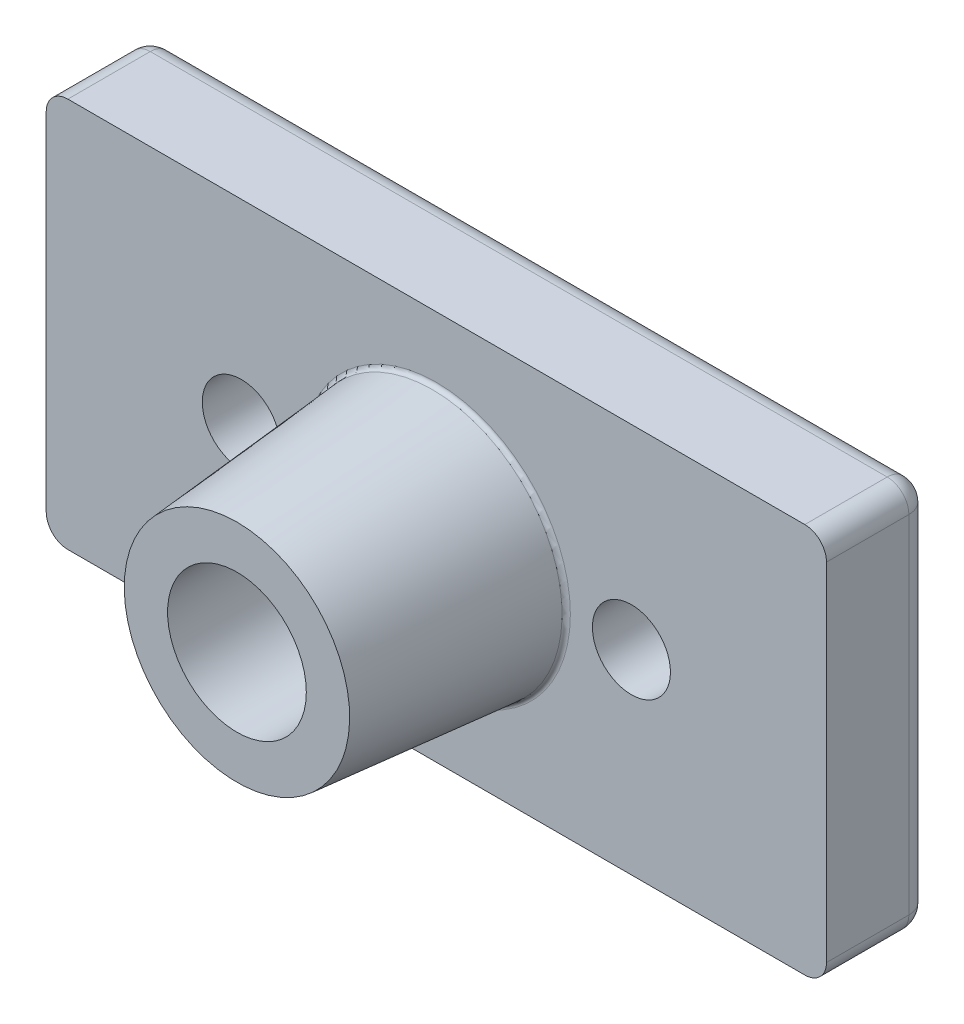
ISO-10303-21;
HEADER;
FILE_DESCRIPTION(('STEP AP214'),'2;1');
FILE_NAME('part.step','',(''),(''),'','','');
FILE_SCHEMA(('AUTOMOTIVE_DESIGN { 1 0 10303 214 1 1 1 1 }'));
ENDSEC;
DATA;
#1=APPLICATION_CONTEXT('core data for automotive mechanical design processes');
#2=APPLICATION_PROTOCOL_DEFINITION('international standard','automotive_design',2000,#1);
#3=PRODUCT_CONTEXT('',#1,'mechanical');
#4=PRODUCT('Part','Part','',(#3));
#5=PRODUCT_RELATED_PRODUCT_CATEGORY('part','',(#4));
#6=PRODUCT_DEFINITION_FORMATION('','',#4);
#7=PRODUCT_DEFINITION_CONTEXT('part definition',#1,'design');
#8=PRODUCT_DEFINITION('design','',#6,#7);
#9=PRODUCT_DEFINITION_SHAPE('','',#8);
#10=(LENGTH_UNIT() NAMED_UNIT(*) SI_UNIT(.MILLI.,.METRE.));
#11=(NAMED_UNIT(*) PLANE_ANGLE_UNIT() SI_UNIT($,.RADIAN.));
#12=(NAMED_UNIT(*) SI_UNIT($,.STERADIAN.) SOLID_ANGLE_UNIT());
#13=UNCERTAINTY_MEASURE_WITH_UNIT(LENGTH_MEASURE(1.E-05),#10,'distance_accuracy_value','');
#14=(GEOMETRIC_REPRESENTATION_CONTEXT(3) GLOBAL_UNCERTAINTY_ASSIGNED_CONTEXT((#13)) GLOBAL_UNIT_ASSIGNED_CONTEXT((#10,
#11,#12)) REPRESENTATION_CONTEXT('',''));
#15=CARTESIAN_POINT('',(0.,0.,0.));
#16=DIRECTION('',(0.,0.,1.));
#17=DIRECTION('',(1.,0.,0.));
#18=AXIS2_PLACEMENT_3D('',#15,#16,#17);
#19=CARTESIAN_POINT('',(0.,0.,0.));
#20=DIRECTION('',(0.,0.,1.));
#21=DIRECTION('',(1.,0.,0.));
#22=AXIS2_PLACEMENT_3D('',#19,#20,#21);
#23=CYLINDRICAL_SURFACE('',#22,8.);
#24=CARTESIAN_POINT('',(0.,0.,0.));
#25=DIRECTION('',(0.,0.,1.));
#26=DIRECTION('',(1.,0.,0.));
#27=AXIS2_PLACEMENT_3D('',#24,#25,#26);
#28=CIRCLE('',#27,8.);
#29=CARTESIAN_POINT('',(8.,0.,0.));
#30=VERTEX_POINT('',#29);
#31=EDGE_CURVE('E19',#30,#30,#28,.F.);
#32=ORIENTED_EDGE('',*,*,#31,.T.);
#33=EDGE_LOOP('',(#32));
#34=FACE_BOUND('',#33,.T.);
#35=CARTESIAN_POINT('',(0.,0.,35.));
#36=DIRECTION('',(0.,0.,1.));
#37=DIRECTION('',(1.,0.,0.));
#38=AXIS2_PLACEMENT_3D('',#35,#36,#37);
#39=CIRCLE('',#38,8.);
#40=CARTESIAN_POINT('',(8.,0.,35.));
#41=VERTEX_POINT('',#40);
#42=EDGE_CURVE('E116',#41,#41,#39,.F.);
#43=ORIENTED_EDGE('',*,*,#42,.F.);
#44=EDGE_LOOP('',(#43));
#45=FACE_BOUND('',#44,.T.);
#46=ADVANCED_FACE('F15',(#34,#45),#23,.F.);
#47=CARTESIAN_POINT('',(0.,0.,0.));
#48=DIRECTION('',(0.,0.,1.));
#49=DIRECTION('',(1.,0.,0.));
#50=AXIS2_PLACEMENT_3D('',#47,#48,#49);
#51=PLANE('',#50);
#52=CARTESIAN_POINT('',(22.5,0.,0.));
#53=DIRECTION('',(0.,0.,1.));
#54=DIRECTION('',(1.,0.,0.));
#55=AXIS2_PLACEMENT_3D('',#52,#53,#54);
#56=CIRCLE('',#55,7.5);
#57=CARTESIAN_POINT('',(30.,0.,0.));
#58=VERTEX_POINT('',#57);
#59=EDGE_CURVE('E120',#58,#58,#56,.T.);
#60=ORIENTED_EDGE('',*,*,#59,.T.);
#61=EDGE_LOOP('',(#60));
#62=FACE_BOUND('',#61,.T.);
#63=CARTESIAN_POINT('',(-22.5,0.,0.));
#64=DIRECTION('',(0.,0.,1.));
#65=DIRECTION('',(1.,0.,0.));
#66=AXIS2_PLACEMENT_3D('',#63,#64,#65);
#67=CIRCLE('',#66,7.5);
#68=CARTESIAN_POINT('',(-15.,0.,0.));
#69=VERTEX_POINT('',#68);
#70=EDGE_CURVE('E122',#69,#69,#67,.T.);
#71=ORIENTED_EDGE('',*,*,#70,.T.);
#72=EDGE_LOOP('',(#71));
#73=FACE_BOUND('',#72,.T.);
#74=ORIENTED_EDGE('',*,*,#31,.F.);
#75=EDGE_LOOP('',(#74));
#76=FACE_BOUND('',#75,.T.);
#77=DIRECTION('',(0.,-1.,0.));
#78=VECTOR('',#77,1.);
#79=CARTESIAN_POINT('',(-42.5,-10.,0.));
#80=LINE('',#79,#78);
#81=CARTESIAN_POINT('',(-42.5,20.,0.));
#82=VERTEX_POINT('',#81);
#83=CARTESIAN_POINT('',(-42.5,-20.,0.));
#84=VERTEX_POINT('',#83);
#85=EDGE_CURVE('E142',#82,#84,#80,.T.);
#86=ORIENTED_EDGE('',*,*,#85,.F.);
#87=DIRECTION('',(-1.,0.,0.));
#88=VECTOR('',#87,1.);
#89=CARTESIAN_POINT('',(-21.25,20.,0.));
#90=LINE('',#89,#88);
#91=CARTESIAN_POINT('',(42.5,20.,0.));
#92=VERTEX_POINT('',#91);
#93=EDGE_CURVE('E119',#92,#82,#90,.T.);
#94=ORIENTED_EDGE('',*,*,#93,.F.);
#95=DIRECTION('',(0.,1.,0.));
#96=VECTOR('',#95,1.);
#97=CARTESIAN_POINT('',(42.5,10.,0.));
#98=LINE('',#97,#96);
#99=CARTESIAN_POINT('',(42.5,-20.,0.));
#100=VERTEX_POINT('',#99);
#101=EDGE_CURVE('E266',#100,#92,#98,.T.);
#102=ORIENTED_EDGE('',*,*,#101,.F.);
#103=DIRECTION('',(1.,0.,0.));
#104=VECTOR('',#103,1.);
#105=CARTESIAN_POINT('',(21.25,-20.,0.));
#106=LINE('',#105,#104);
#107=EDGE_CURVE('E149',#84,#100,#106,.T.);
#108=ORIENTED_EDGE('',*,*,#107,.F.);
#109=EDGE_LOOP('',(#86,#94,#102,#108));
#110=FACE_BOUND('',#109,.T.);
#111=ADVANCED_FACE('F131',(#62,#73,#76,#110),#51,.F.);
#112=CARTESIAN_POINT('',(-22.5,0.,0.));
#113=DIRECTION('',(0.,0.,1.));
#114=DIRECTION('',(1.,0.,0.));
#115=AXIS2_PLACEMENT_3D('',#112,#113,#114);
#116=CYLINDRICAL_SURFACE('',#115,7.5);
#117=CARTESIAN_POINT('',(-22.5,0.,5.5));
#118=DIRECTION('',(0.,0.,1.));
#119=DIRECTION('',(1.,0.,0.));
#120=AXIS2_PLACEMENT_3D('',#117,#118,#119);
#121=CIRCLE('',#120,7.5);
#122=CARTESIAN_POINT('',(-15.,0.,5.5));
#123=VERTEX_POINT('',#122);
#124=EDGE_CURVE('E112',#123,#123,#121,.T.);
#125=ORIENTED_EDGE('',*,*,#124,.T.);
#126=EDGE_LOOP('',(#125));
#127=FACE_BOUND('',#126,.T.);
#128=ORIENTED_EDGE('',*,*,#70,.F.);
#129=EDGE_LOOP('',(#128));
#130=FACE_BOUND('',#129,.T.);
#131=ADVANCED_FACE('F134',(#127,#130),#116,.F.);
#132=CARTESIAN_POINT('',(22.5,0.,0.));
#133=DIRECTION('',(0.,0.,1.));
#134=DIRECTION('',(1.,0.,0.));
#135=AXIS2_PLACEMENT_3D('',#132,#133,#134);
#136=CYLINDRICAL_SURFACE('',#135,7.5);
#137=CARTESIAN_POINT('',(22.5,0.,5.5));
#138=DIRECTION('',(0.,0.,1.));
#139=DIRECTION('',(1.,0.,0.));
#140=AXIS2_PLACEMENT_3D('',#137,#138,#139);
#141=CIRCLE('',#140,7.5);
#142=CARTESIAN_POINT('',(30.,0.,5.5));
#143=VERTEX_POINT('',#142);
#144=EDGE_CURVE('E109',#143,#143,#141,.T.);
#145=ORIENTED_EDGE('',*,*,#144,.T.);
#146=EDGE_LOOP('',(#145));
#147=FACE_BOUND('',#146,.T.);
#148=ORIENTED_EDGE('',*,*,#59,.F.);
#149=EDGE_LOOP('',(#148));
#150=FACE_BOUND('',#149,.T.);
#151=ADVANCED_FACE('F182',(#147,#150),#136,.F.);
#152=CARTESIAN_POINT('',(-10.5,0.,35.));
#153=DIRECTION('',(0.,0.,1.));
#154=DIRECTION('',(1.,0.,0.));
#155=AXIS2_PLACEMENT_3D('',#152,#153,#154);
#156=PLANE('',#155);
#157=ORIENTED_EDGE('',*,*,#42,.T.);
#158=EDGE_LOOP('',(#157));
#159=FACE_BOUND('',#158,.T.);
#160=CARTESIAN_POINT('',(0.,0.,35.0000000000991));
#161=DIRECTION('',(0.,0.,-1.));
#162=DIRECTION('',(0.,1.,0.));
#163=AXIS2_PLACEMENT_3D('',#160,#161,#162);
#164=CIRCLE('',#163,13.0000000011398);
#165=CARTESIAN_POINT('',(0.,13.0000000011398,35.0000000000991));
#166=VERTEX_POINT('',#165);
#167=EDGE_CURVE('E105',#166,#166,#164,.T.);
#168=ORIENTED_EDGE('',*,*,#167,.F.);
#169=EDGE_LOOP('',(#168));
#170=FACE_BOUND('',#169,.T.);
#171=ADVANCED_FACE('F179',(#159,#170),#156,.T.);
#172=CARTESIAN_POINT('',(-21.25,20.,2.5));
#173=DIRECTION('',(-1.,0.,0.));
#174=DIRECTION('',(0.,0.,1.));
#175=AXIS2_PLACEMENT_3D('',#172,#173,#174);
#176=CYLINDRICAL_SURFACE('',#175,2.5);
#177=CARTESIAN_POINT('',(-42.5,20.,2.5));
#178=DIRECTION('',(1.,0.,0.));
#179=DIRECTION('',(0.,1.,0.));
#180=AXIS2_PLACEMENT_3D('',#177,#178,#179);
#181=CIRCLE('',#180,2.5);
#182=CARTESIAN_POINT('',(-42.5,22.5,2.5));
#183=VERTEX_POINT('',#182);
#184=EDGE_CURVE('E162',#183,#82,#181,.F.);
#185=ORIENTED_EDGE('',*,*,#184,.F.);
#186=DIRECTION('',(1.,0.,0.));
#187=VECTOR('',#186,1.);
#188=CARTESIAN_POINT('',(-42.5,22.5,2.5));
#189=LINE('',#188,#187);
#190=CARTESIAN_POINT('',(42.5,22.5,2.5));
#191=VERTEX_POINT('',#190);
#192=EDGE_CURVE('E108',#191,#183,#189,.F.);
#193=ORIENTED_EDGE('',*,*,#192,.F.);
#194=CARTESIAN_POINT('',(42.5,20.,2.5));
#195=DIRECTION('',(1.,0.,0.));
#196=DIRECTION('',(0.,1.,0.));
#197=AXIS2_PLACEMENT_3D('',#194,#195,#196);
#198=CIRCLE('',#197,2.5);
#199=EDGE_CURVE('E263',#92,#191,#198,.T.);
#200=ORIENTED_EDGE('',*,*,#199,.F.);
#201=ORIENTED_EDGE('',*,*,#93,.T.);
#202=EDGE_LOOP('',(#185,#193,#200,#201));
#203=FACE_BOUND('',#202,.T.);
#204=ADVANCED_FACE('F175',(#203),#176,.T.);
#205=CARTESIAN_POINT('',(-42.5,20.,2.5));
#206=DIRECTION('',(1.,0.,0.));
#207=DIRECTION('',(0.,1.,0.));
#208=AXIS2_PLACEMENT_3D('',#205,#206,#207);
#209=SPHERICAL_SURFACE('',#208,2.5);
#210=CARTESIAN_POINT('',(-42.5,20.,2.5));
#211=DIRECTION('',(0.,0.,1.));
#212=DIRECTION('',(1.,0.,0.));
#213=AXIS2_PLACEMENT_3D('',#210,#211,#212);
#214=CIRCLE('',#213,2.5);
#215=CARTESIAN_POINT('',(-45.,20.,2.5));
#216=VERTEX_POINT('',#215);
#217=EDGE_CURVE('E73',#183,#216,#214,.T.);
#218=ORIENTED_EDGE('',*,*,#217,.F.);
#219=ORIENTED_EDGE('',*,*,#184,.T.);
#220=CARTESIAN_POINT('',(-42.5,20.,2.5));
#221=DIRECTION('',(0.,-1.,0.));
#222=DIRECTION('',(0.,0.,-1.));
#223=AXIS2_PLACEMENT_3D('',#220,#221,#222);
#224=CIRCLE('',#223,2.5);
#225=EDGE_CURVE('E155',#216,#82,#224,.T.);
#226=ORIENTED_EDGE('',*,*,#225,.F.);
#227=EDGE_LOOP('',(#218,#219,#226));
#228=FACE_BOUND('',#227,.T.);
#229=ADVANCED_FACE('F171',(#228),#209,.T.);
#230=CARTESIAN_POINT('',(-42.5,-10.,2.5));
#231=DIRECTION('',(0.,-1.,0.));
#232=DIRECTION('',(0.,0.,-1.));
#233=AXIS2_PLACEMENT_3D('',#230,#231,#232);
#234=CYLINDRICAL_SURFACE('',#233,2.5);
#235=CARTESIAN_POINT('',(-42.5,-20.,2.5));
#236=DIRECTION('',(0.,1.,0.));
#237=DIRECTION('',(1.,0.,0.));
#238=AXIS2_PLACEMENT_3D('',#235,#236,#237);
#239=CIRCLE('',#238,2.5);
#240=CARTESIAN_POINT('',(-45.,-20.,2.5));
#241=VERTEX_POINT('',#240);
#242=EDGE_CURVE('E154',#241,#84,#239,.F.);
#243=ORIENTED_EDGE('',*,*,#242,.F.);
#244=DIRECTION('',(0.,1.,0.));
#245=VECTOR('',#244,1.);
#246=CARTESIAN_POINT('',(-45.,-20.,2.5));
#247=LINE('',#246,#245);
#248=EDGE_CURVE('E77',#216,#241,#247,.F.);
#249=ORIENTED_EDGE('',*,*,#248,.F.);
#250=ORIENTED_EDGE('',*,*,#225,.T.);
#251=ORIENTED_EDGE('',*,*,#85,.T.);
#252=EDGE_LOOP('',(#243,#249,#250,#251));
#253=FACE_BOUND('',#252,.T.);
#254=ADVANCED_FACE('F159',(#253),#234,.T.);
#255=CARTESIAN_POINT('',(-42.5,-20.,2.5));
#256=DIRECTION('',(1.,0.,0.));
#257=DIRECTION('',(0.,1.,0.));
#258=AXIS2_PLACEMENT_3D('',#255,#256,#257);
#259=SPHERICAL_SURFACE('',#258,2.5);
#260=CARTESIAN_POINT('',(-42.5,-20.,2.5));
#261=DIRECTION('',(0.,0.,1.));
#262=DIRECTION('',(1.,0.,0.));
#263=AXIS2_PLACEMENT_3D('',#260,#261,#262);
#264=CIRCLE('',#263,2.50000000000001);
#265=CARTESIAN_POINT('',(-42.5,-22.5,2.5));
#266=VERTEX_POINT('',#265);
#267=EDGE_CURVE('E76',#241,#266,#264,.T.);
#268=ORIENTED_EDGE('',*,*,#267,.F.);
#269=ORIENTED_EDGE('',*,*,#242,.T.);
#270=CARTESIAN_POINT('',(-42.5,-20.,2.5));
#271=DIRECTION('',(1.,0.,0.));
#272=DIRECTION('',(0.,0.,-1.));
#273=AXIS2_PLACEMENT_3D('',#270,#271,#272);
#274=CIRCLE('',#273,2.5);
#275=EDGE_CURVE('E296',#266,#84,#274,.T.);
#276=ORIENTED_EDGE('',*,*,#275,.F.);
#277=EDGE_LOOP('',(#268,#269,#276));
#278=FACE_BOUND('',#277,.T.);
#279=ADVANCED_FACE('F288',(#278),#259,.T.);
#280=CARTESIAN_POINT('',(21.25,-20.,2.5));
#281=DIRECTION('',(1.,0.,0.));
#282=DIRECTION('',(0.,0.,-1.));
#283=AXIS2_PLACEMENT_3D('',#280,#281,#282);
#284=CYLINDRICAL_SURFACE('',#283,2.5);
#285=CARTESIAN_POINT('',(42.5,-20.,2.5));
#286=DIRECTION('',(1.,0.,0.));
#287=DIRECTION('',(0.,1.,0.));
#288=AXIS2_PLACEMENT_3D('',#285,#286,#287);
#289=CIRCLE('',#288,2.5);
#290=CARTESIAN_POINT('',(42.5,-22.5,2.50000000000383));
#291=VERTEX_POINT('',#290);
#292=EDGE_CURVE('E275',#291,#100,#289,.T.);
#293=ORIENTED_EDGE('',*,*,#292,.F.);
#294=DIRECTION('',(1.,0.,0.));
#295=VECTOR('',#294,1.);
#296=CARTESIAN_POINT('',(42.5,-22.5,2.5));
#297=LINE('',#296,#295);
#298=EDGE_CURVE('E276',#266,#291,#297,.T.);
#299=ORIENTED_EDGE('',*,*,#298,.F.);
#300=ORIENTED_EDGE('',*,*,#275,.T.);
#301=ORIENTED_EDGE('',*,*,#107,.T.);
#302=EDGE_LOOP('',(#293,#299,#300,#301));
#303=FACE_BOUND('',#302,.T.);
#304=ADVANCED_FACE('F285',(#303),#284,.T.);
#305=CARTESIAN_POINT('',(42.5,-20.,2.5));
#306=DIRECTION('',(1.,0.,0.));
#307=DIRECTION('',(0.,1.,0.));
#308=AXIS2_PLACEMENT_3D('',#305,#306,#307);
#309=SPHERICAL_SURFACE('',#308,2.5);
#310=CARTESIAN_POINT('',(42.5,-20.,2.5));
#311=DIRECTION('',(0.,0.,1.));
#312=DIRECTION('',(1.,0.,0.));
#313=AXIS2_PLACEMENT_3D('',#310,#311,#312);
#314=CIRCLE('',#313,2.5);
#315=CARTESIAN_POINT('',(45.,-20.,2.5));
#316=VERTEX_POINT('',#315);
#317=EDGE_CURVE('E267',#291,#316,#314,.T.);
#318=ORIENTED_EDGE('',*,*,#317,.F.);
#319=ORIENTED_EDGE('',*,*,#292,.T.);
#320=CARTESIAN_POINT('',(42.5,-20.,2.5));
#321=DIRECTION('',(0.,1.,0.));
#322=DIRECTION('',(0.,0.,1.));
#323=AXIS2_PLACEMENT_3D('',#320,#321,#322);
#324=CIRCLE('',#323,2.5);
#325=EDGE_CURVE('E272',#316,#100,#324,.T.);
#326=ORIENTED_EDGE('',*,*,#325,.F.);
#327=EDGE_LOOP('',(#318,#319,#326));
#328=FACE_BOUND('',#327,.T.);
#329=ADVANCED_FACE('F282',(#328),#309,.T.);
#330=CARTESIAN_POINT('',(42.5,10.,2.5));
#331=DIRECTION('',(0.,1.,0.));
#332=DIRECTION('',(0.,0.,1.));
#333=AXIS2_PLACEMENT_3D('',#330,#331,#332);
#334=CYLINDRICAL_SURFACE('',#333,2.5);
#335=CARTESIAN_POINT('',(42.5,20.,2.5));
#336=DIRECTION('',(0.,1.,0.));
#337=DIRECTION('',(1.,0.,0.));
#338=AXIS2_PLACEMENT_3D('',#335,#336,#337);
#339=CIRCLE('',#338,2.5);
#340=CARTESIAN_POINT('',(45.,20.,2.5));
#341=VERTEX_POINT('',#340);
#342=EDGE_CURVE('E115',#341,#92,#339,.T.);
#343=ORIENTED_EDGE('',*,*,#342,.F.);
#344=DIRECTION('',(0.,1.,0.));
#345=VECTOR('',#344,1.);
#346=CARTESIAN_POINT('',(45.,20.,2.5));
#347=LINE('',#346,#345);
#348=EDGE_CURVE('E310',#316,#341,#347,.T.);
#349=ORIENTED_EDGE('',*,*,#348,.F.);
#350=ORIENTED_EDGE('',*,*,#325,.T.);
#351=ORIENTED_EDGE('',*,*,#101,.T.);
#352=EDGE_LOOP('',(#343,#349,#350,#351));
#353=FACE_BOUND('',#352,.T.);
#354=ADVANCED_FACE('F254',(#353),#334,.T.);
#355=CARTESIAN_POINT('',(42.5,20.,2.5));
#356=DIRECTION('',(1.,0.,0.));
#357=DIRECTION('',(0.,1.,0.));
#358=AXIS2_PLACEMENT_3D('',#355,#356,#357);
#359=SPHERICAL_SURFACE('',#358,2.5);
#360=CARTESIAN_POINT('',(42.5,20.,2.5));
#361=DIRECTION('',(0.,0.,1.));
#362=DIRECTION('',(1.,0.,0.));
#363=AXIS2_PLACEMENT_3D('',#360,#361,#362);
#364=CIRCLE('',#363,2.5);
#365=EDGE_CURVE('E312',#341,#191,#364,.T.);
#366=ORIENTED_EDGE('',*,*,#365,.F.);
#367=ORIENTED_EDGE('',*,*,#342,.T.);
#368=ORIENTED_EDGE('',*,*,#199,.T.);
#369=EDGE_LOOP('',(#366,#367,#368));
#370=FACE_BOUND('',#369,.T.);
#371=ADVANCED_FACE('F196',(#370),#359,.T.);
#372=CARTESIAN_POINT('',(-14.85,7.65,5.5));
#373=DIRECTION('',(0.,0.,1.));
#374=DIRECTION('',(-1.,0.,0.));
#375=AXIS2_PLACEMENT_3D('',#372,#373,#374);
#376=PLANE('',#375);
#377=CARTESIAN_POINT('',(-22.5,0.,5.5));
#378=DIRECTION('',(0.,0.,1.));
#379=DIRECTION('',(1.,0.,0.));
#380=AXIS2_PLACEMENT_3D('',#377,#378,#379);
#381=CIRCLE('',#380,4.5);
#382=CARTESIAN_POINT('',(-18.,0.,5.5));
#383=VERTEX_POINT('',#382);
#384=EDGE_CURVE('E102',#383,#383,#381,.T.);
#385=ORIENTED_EDGE('',*,*,#384,.T.);
#386=EDGE_LOOP('',(#385));
#387=FACE_BOUND('',#386,.T.);
#388=ORIENTED_EDGE('',*,*,#124,.F.);
#389=EDGE_LOOP('',(#388));
#390=FACE_BOUND('',#389,.T.);
#391=ADVANCED_FACE('F193',(#387,#390),#376,.F.);
#392=CARTESIAN_POINT('',(30.15,7.65,5.5));
#393=DIRECTION('',(0.,0.,1.));
#394=DIRECTION('',(-1.,0.,0.));
#395=AXIS2_PLACEMENT_3D('',#392,#393,#394);
#396=PLANE('',#395);
#397=CARTESIAN_POINT('',(22.5,0.,5.5));
#398=DIRECTION('',(0.,0.,1.));
#399=DIRECTION('',(1.,0.,0.));
#400=AXIS2_PLACEMENT_3D('',#397,#398,#399);
#401=CIRCLE('',#400,4.5);
#402=CARTESIAN_POINT('',(27.,0.,5.5));
#403=VERTEX_POINT('',#402);
#404=EDGE_CURVE('E99',#403,#403,#401,.T.);
#405=ORIENTED_EDGE('',*,*,#404,.T.);
#406=EDGE_LOOP('',(#405));
#407=FACE_BOUND('',#406,.T.);
#408=ORIENTED_EDGE('',*,*,#144,.F.);
#409=EDGE_LOOP('',(#408));
#410=FACE_BOUND('',#409,.T.);
#411=ADVANCED_FACE('F195',(#407,#410),#396,.F.);
#412=CARTESIAN_POINT('',(0.,0.,12.4566851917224));
#413=DIRECTION('',(0.,0.,-1.));
#414=DIRECTION('',(0.,1.,0.));
#415=AXIS2_PLACEMENT_3D('',#412,#413,#414);
#416=CONICAL_SURFACE('',#415,14.9602882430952,0.0867383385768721);
#417=CARTESIAN_POINT('',(0.,0.,12.4566851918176));
#418=DIRECTION('',(0.,0.,-1.));
#419=DIRECTION('',(0.,1.,0.));
#420=AXIS2_PLACEMENT_3D('',#417,#418,#419);
#421=CIRCLE('',#420,14.9602882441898);
#422=CARTESIAN_POINT('',(0.,14.9602882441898,12.4566851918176));
#423=VERTEX_POINT('',#422);
#424=EDGE_CURVE('E94',#423,#423,#421,.T.);
#425=ORIENTED_EDGE('',*,*,#424,.F.);
#426=EDGE_LOOP('',(#425));
#427=FACE_BOUND('',#426,.T.);
#428=ORIENTED_EDGE('',*,*,#167,.T.);
#429=EDGE_LOOP('',(#428));
#430=FACE_BOUND('',#429,.T.);
#431=ADVANCED_FACE('F199',(#427,#430),#416,.T.);
#432=CARTESIAN_POINT('',(-42.5,22.5,0.));
#433=DIRECTION('',(0.,1.,0.));
#434=DIRECTION('',(0.,0.,1.));
#435=AXIS2_PLACEMENT_3D('',#432,#433,#434);
#436=PLANE('',#435);
#437=DIRECTION('',(1.,0.,0.));
#438=VECTOR('',#437,1.);
#439=CARTESIAN_POINT('',(0.,22.5,12.));
#440=LINE('',#439,#438);
#441=CARTESIAN_POINT('',(42.5,22.5,12.));
#442=VERTEX_POINT('',#441);
#443=CARTESIAN_POINT('',(-42.5,22.5,12.));
#444=VERTEX_POINT('',#443);
#445=EDGE_CURVE('E92',#442,#444,#440,.F.);
#446=ORIENTED_EDGE('',*,*,#445,.F.);
#447=DIRECTION('',(0.,0.,1.));
#448=VECTOR('',#447,1.);
#449=CARTESIAN_POINT('',(42.5,22.5,0.));
#450=LINE('',#449,#448);
#451=EDGE_CURVE('E314',#191,#442,#450,.T.);
#452=ORIENTED_EDGE('',*,*,#451,.F.);
#453=ORIENTED_EDGE('',*,*,#192,.T.);
#454=DIRECTION('',(0.,0.,1.));
#455=VECTOR('',#454,1.);
#456=CARTESIAN_POINT('',(-42.5,22.5,0.));
#457=LINE('',#456,#455);
#458=EDGE_CURVE('E59',#444,#183,#457,.F.);
#459=ORIENTED_EDGE('',*,*,#458,.F.);
#460=EDGE_LOOP('',(#446,#452,#453,#459));
#461=FACE_BOUND('',#460,.T.);
#462=ADVANCED_FACE('F205',(#461),#436,.T.);
#463=CARTESIAN_POINT('',(-42.5,20.,0.));
#464=DIRECTION('',(0.,0.,1.));
#465=DIRECTION('',(1.,0.,0.));
#466=AXIS2_PLACEMENT_3D('',#463,#464,#465);
#467=CYLINDRICAL_SURFACE('',#466,2.5);
#468=CARTESIAN_POINT('',(-42.5,20.,12.));
#469=DIRECTION('',(0.,0.,1.));
#470=DIRECTION('',(1.,0.,0.));
#471=AXIS2_PLACEMENT_3D('',#468,#469,#470);
#472=CIRCLE('',#471,2.5);
#473=CARTESIAN_POINT('',(-45.,20.,12.));
#474=VERTEX_POINT('',#473);
#475=EDGE_CURVE('E69',#444,#474,#472,.T.);
#476=ORIENTED_EDGE('',*,*,#475,.F.);
#477=ORIENTED_EDGE('',*,*,#458,.T.);
#478=ORIENTED_EDGE('',*,*,#217,.T.);
#479=DIRECTION('',(0.,0.,1.));
#480=VECTOR('',#479,1.);
#481=CARTESIAN_POINT('',(-45.,20.,0.));
#482=LINE('',#481,#480);
#483=EDGE_CURVE('E65',#474,#216,#482,.F.);
#484=ORIENTED_EDGE('',*,*,#483,.F.);
#485=EDGE_LOOP('',(#476,#477,#478,#484));
#486=FACE_BOUND('',#485,.T.);
#487=ADVANCED_FACE('F67',(#486),#467,.T.);
#488=CARTESIAN_POINT('',(-45.,-20.,0.));
#489=DIRECTION('',(-1.,0.,0.));
#490=DIRECTION('',(0.,0.,1.));
#491=AXIS2_PLACEMENT_3D('',#488,#489,#490);
#492=PLANE('',#491);
#493=DIRECTION('',(0.,1.,0.));
#494=VECTOR('',#493,1.);
#495=CARTESIAN_POINT('',(-45.,0.,12.));
#496=LINE('',#495,#494);
#497=CARTESIAN_POINT('',(-45.,-20.,12.));
#498=VERTEX_POINT('',#497);
#499=EDGE_CURVE('E80',#474,#498,#496,.F.);
#500=ORIENTED_EDGE('',*,*,#499,.F.);
#501=ORIENTED_EDGE('',*,*,#483,.T.);
#502=ORIENTED_EDGE('',*,*,#248,.T.);
#503=DIRECTION('',(0.,0.,1.));
#504=VECTOR('',#503,1.);
#505=CARTESIAN_POINT('',(-45.,-20.,0.));
#506=LINE('',#505,#504);
#507=EDGE_CURVE('E83',#498,#241,#506,.F.);
#508=ORIENTED_EDGE('',*,*,#507,.F.);
#509=EDGE_LOOP('',(#500,#501,#502,#508));
#510=FACE_BOUND('',#509,.T.);
#511=ADVANCED_FACE('F81',(#510),#492,.T.);
#512=CARTESIAN_POINT('',(-42.5,-20.,0.));
#513=DIRECTION('',(0.,0.,1.));
#514=DIRECTION('',(1.,0.,0.));
#515=AXIS2_PLACEMENT_3D('',#512,#513,#514);
#516=CYLINDRICAL_SURFACE('',#515,2.50000000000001);
#517=CARTESIAN_POINT('',(-42.5,-20.,12.));
#518=DIRECTION('',(0.,0.,1.));
#519=DIRECTION('',(1.,0.,0.));
#520=AXIS2_PLACEMENT_3D('',#517,#518,#519);
#521=CIRCLE('',#520,2.50000000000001);
#522=CARTESIAN_POINT('',(-42.5,-22.5,12.));
#523=VERTEX_POINT('',#522);
#524=EDGE_CURVE('E87',#498,#523,#521,.T.);
#525=ORIENTED_EDGE('',*,*,#524,.F.);
#526=ORIENTED_EDGE('',*,*,#507,.T.);
#527=ORIENTED_EDGE('',*,*,#267,.T.);
#528=DIRECTION('',(0.,0.,-1.));
#529=VECTOR('',#528,1.);
#530=CARTESIAN_POINT('',(-42.5,-22.5,0.));
#531=LINE('',#530,#529);
#532=EDGE_CURVE('E271',#523,#266,#531,.T.);
#533=ORIENTED_EDGE('',*,*,#532,.F.);
#534=EDGE_LOOP('',(#525,#526,#527,#533));
#535=FACE_BOUND('',#534,.T.);
#536=ADVANCED_FACE('F240',(#535),#516,.T.);
#537=CARTESIAN_POINT('',(42.5,-22.5,0.));
#538=DIRECTION('',(0.,-1.,0.));
#539=DIRECTION('',(0.,0.,-1.));
#540=AXIS2_PLACEMENT_3D('',#537,#538,#539);
#541=PLANE('',#540);
#542=DIRECTION('',(1.,0.,0.));
#543=VECTOR('',#542,1.);
#544=CARTESIAN_POINT('',(0.,-22.5,12.));
#545=LINE('',#544,#543);
#546=CARTESIAN_POINT('',(42.5,-22.5,12.));
#547=VERTEX_POINT('',#546);
#548=EDGE_CURVE('E332',#523,#547,#545,.T.);
#549=ORIENTED_EDGE('',*,*,#548,.F.);
#550=ORIENTED_EDGE('',*,*,#532,.T.);
#551=ORIENTED_EDGE('',*,*,#298,.T.);
#552=DIRECTION('',(0.,0.,1.));
#553=VECTOR('',#552,1.);
#554=CARTESIAN_POINT('',(42.5,-22.5,0.));
#555=LINE('',#554,#553);
#556=EDGE_CURVE('E270',#547,#291,#555,.F.);
#557=ORIENTED_EDGE('',*,*,#556,.F.);
#558=EDGE_LOOP('',(#549,#550,#551,#557));
#559=FACE_BOUND('',#558,.T.);
#560=ADVANCED_FACE('F236',(#559),#541,.T.);
#561=CARTESIAN_POINT('',(42.5,-20.,0.));
#562=DIRECTION('',(0.,0.,1.));
#563=DIRECTION('',(1.,0.,0.));
#564=AXIS2_PLACEMENT_3D('',#561,#562,#563);
#565=CYLINDRICAL_SURFACE('',#564,2.5);
#566=CARTESIAN_POINT('',(42.5,-20.,12.));
#567=DIRECTION('',(0.,0.,1.));
#568=DIRECTION('',(1.,0.,0.));
#569=AXIS2_PLACEMENT_3D('',#566,#567,#568);
#570=CIRCLE('',#569,2.5);
#571=CARTESIAN_POINT('',(45.,-20.,12.));
#572=VERTEX_POINT('',#571);
#573=EDGE_CURVE('E327',#547,#572,#570,.T.);
#574=ORIENTED_EDGE('',*,*,#573,.F.);
#575=ORIENTED_EDGE('',*,*,#556,.T.);
#576=ORIENTED_EDGE('',*,*,#317,.T.);
#577=DIRECTION('',(0.,0.,-1.));
#578=VECTOR('',#577,1.);
#579=CARTESIAN_POINT('',(45.,-20.,0.));
#580=LINE('',#579,#578);
#581=EDGE_CURVE('E311',#572,#316,#580,.T.);
#582=ORIENTED_EDGE('',*,*,#581,.F.);
#583=EDGE_LOOP('',(#574,#575,#576,#582));
#584=FACE_BOUND('',#583,.T.);
#585=ADVANCED_FACE('F233',(#584),#565,.T.);
#586=CARTESIAN_POINT('',(45.,20.,0.));
#587=DIRECTION('',(1.,0.,0.));
#588=DIRECTION('',(0.,0.,-1.));
#589=AXIS2_PLACEMENT_3D('',#586,#587,#588);
#590=PLANE('',#589);
#591=DIRECTION('',(0.,1.,0.));
#592=VECTOR('',#591,1.);
#593=CARTESIAN_POINT('',(45.,0.,12.));
#594=LINE('',#593,#592);
#595=CARTESIAN_POINT('',(45.,20.,12.));
#596=VERTEX_POINT('',#595);
#597=EDGE_CURVE('E355',#572,#596,#594,.T.);
#598=ORIENTED_EDGE('',*,*,#597,.F.);
#599=ORIENTED_EDGE('',*,*,#581,.T.);
#600=ORIENTED_EDGE('',*,*,#348,.T.);
#601=DIRECTION('',(0.,0.,1.));
#602=VECTOR('',#601,1.);
#603=CARTESIAN_POINT('',(45.,20.,0.));
#604=LINE('',#603,#602);
#605=EDGE_CURVE('E34',#596,#341,#604,.F.);
#606=ORIENTED_EDGE('',*,*,#605,.F.);
#607=EDGE_LOOP('',(#598,#599,#600,#606));
#608=FACE_BOUND('',#607,.T.);
#609=ADVANCED_FACE('F229',(#608),#590,.T.);
#610=CARTESIAN_POINT('',(42.5,20.,0.));
#611=DIRECTION('',(0.,0.,1.));
#612=DIRECTION('',(1.,0.,0.));
#613=AXIS2_PLACEMENT_3D('',#610,#611,#612);
#614=CYLINDRICAL_SURFACE('',#613,2.5);
#615=CARTESIAN_POINT('',(42.5,20.,12.));
#616=DIRECTION('',(0.,0.,1.));
#617=DIRECTION('',(1.,0.,0.));
#618=AXIS2_PLACEMENT_3D('',#615,#616,#617);
#619=CIRCLE('',#618,2.5);
#620=EDGE_CURVE('E352',#596,#442,#619,.T.);
#621=ORIENTED_EDGE('',*,*,#620,.F.);
#622=ORIENTED_EDGE('',*,*,#605,.T.);
#623=ORIENTED_EDGE('',*,*,#365,.T.);
#624=ORIENTED_EDGE('',*,*,#451,.T.);
#625=EDGE_LOOP('',(#621,#622,#623,#624));
#626=FACE_BOUND('',#625,.T.);
#627=ADVANCED_FACE('F225',(#626),#614,.T.);
#628=CARTESIAN_POINT('',(-22.5,0.,0.));
#629=DIRECTION('',(0.,0.,1.));
#630=DIRECTION('',(1.,0.,0.));
#631=AXIS2_PLACEMENT_3D('',#628,#629,#630);
#632=CYLINDRICAL_SURFACE('',#631,4.5);
#633=CARTESIAN_POINT('',(-22.5,0.,12.));
#634=DIRECTION('',(0.,0.,1.));
#635=DIRECTION('',(1.,0.,0.));
#636=AXIS2_PLACEMENT_3D('',#633,#634,#635);
#637=CIRCLE('',#636,4.5);
#638=CARTESIAN_POINT('',(-18.,0.,12.));
#639=VERTEX_POINT('',#638);
#640=EDGE_CURVE('E354',#639,#639,#637,.F.);
#641=ORIENTED_EDGE('',*,*,#640,.F.);
#642=EDGE_LOOP('',(#641));
#643=FACE_BOUND('',#642,.T.);
#644=ORIENTED_EDGE('',*,*,#384,.F.);
#645=EDGE_LOOP('',(#644));
#646=FACE_BOUND('',#645,.T.);
#647=ADVANCED_FACE('F221',(#643,#646),#632,.F.);
#648=CARTESIAN_POINT('',(22.5,0.,0.));
#649=DIRECTION('',(0.,0.,1.));
#650=DIRECTION('',(1.,0.,0.));
#651=AXIS2_PLACEMENT_3D('',#648,#649,#650);
#652=CYLINDRICAL_SURFACE('',#651,4.5);
#653=CARTESIAN_POINT('',(22.5,0.,12.));
#654=DIRECTION('',(0.,0.,1.));
#655=DIRECTION('',(1.,0.,0.));
#656=AXIS2_PLACEMENT_3D('',#653,#654,#655);
#657=CIRCLE('',#656,4.5);
#658=CARTESIAN_POINT('',(27.,0.,12.));
#659=VERTEX_POINT('',#658);
#660=EDGE_CURVE('E25',#659,#659,#657,.F.);
#661=ORIENTED_EDGE('',*,*,#660,.F.);
#662=EDGE_LOOP('',(#661));
#663=FACE_BOUND('',#662,.T.);
#664=ORIENTED_EDGE('',*,*,#404,.F.);
#665=EDGE_LOOP('',(#664));
#666=FACE_BOUND('',#665,.T.);
#667=ADVANCED_FACE('F215',(#663,#666),#652,.F.);
#668=CARTESIAN_POINT('',(0.,0.,12.5));
#669=DIRECTION('',(0.,0.,-1.));
#670=DIRECTION('',(0.,1.,0.));
#671=AXIS2_PLACEMENT_3D('',#668,#669,#670);
#672=TOROIDAL_SURFACE('',#671,15.4584085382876,0.500000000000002);
#673=CARTESIAN_POINT('',(0.,0.,12.));
#674=DIRECTION('',(0.,0.,-1.));
#675=DIRECTION('',(0.,1.,0.));
#676=AXIS2_PLACEMENT_3D('',#673,#674,#675);
#677=CIRCLE('',#676,15.4584085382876);
#678=CARTESIAN_POINT('',(0.,15.4584085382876,12.));
#679=VERTEX_POINT('',#678);
#680=EDGE_CURVE('E10',#679,#679,#677,.T.);
#681=ORIENTED_EDGE('',*,*,#680,.F.);
#682=EDGE_LOOP('',(#681));
#683=FACE_BOUND('',#682,.T.);
#684=ORIENTED_EDGE('',*,*,#424,.T.);
#685=EDGE_LOOP('',(#684));
#686=FACE_BOUND('',#685,.T.);
#687=ADVANCED_FACE('F17',(#683,#686),#672,.F.);
#688=CARTESIAN_POINT('',(0.,0.,12.));
#689=DIRECTION('',(0.,0.,1.));
#690=DIRECTION('',(1.,0.,0.));
#691=AXIS2_PLACEMENT_3D('',#688,#689,#690);
#692=PLANE('',#691);
#693=ORIENTED_EDGE('',*,*,#680,.T.);
#694=EDGE_LOOP('',(#693));
#695=FACE_BOUND('',#694,.T.);
#696=ORIENTED_EDGE('',*,*,#660,.T.);
#697=EDGE_LOOP('',(#696));
#698=FACE_BOUND('',#697,.T.);
#699=ORIENTED_EDGE('',*,*,#640,.T.);
#700=EDGE_LOOP('',(#699));
#701=FACE_BOUND('',#700,.T.);
#702=ORIENTED_EDGE('',*,*,#597,.T.);
#703=ORIENTED_EDGE('',*,*,#620,.T.);
#704=ORIENTED_EDGE('',*,*,#445,.T.);
#705=ORIENTED_EDGE('',*,*,#475,.T.);
#706=ORIENTED_EDGE('',*,*,#499,.T.);
#707=ORIENTED_EDGE('',*,*,#524,.T.);
#708=ORIENTED_EDGE('',*,*,#548,.T.);
#709=ORIENTED_EDGE('',*,*,#573,.T.);
#710=EDGE_LOOP('',(#702,#703,#704,#705,#706,#707,#708,#709));
#711=FACE_BOUND('',#710,.T.);
#712=ADVANCED_FACE('F90',(#695,#698,#701,#711),#692,.T.);
#713=CLOSED_SHELL('',(#46,#111,#131,#151,#171,#204,#229,#254,#279,#304,#329,#354,#371,#391,#411,
#431,#462,#487,#511,#536,#560,#585,#609,#627,#647,#667,#687,#712));
#714=MANIFOLD_SOLID_BREP('B1',#713);
#715=ADVANCED_BREP_SHAPE_REPRESENTATION('',(#18,#714),#14);
#716=SHAPE_DEFINITION_REPRESENTATION(#9,#715);
ENDSEC;
END-ISO-10303-21;
